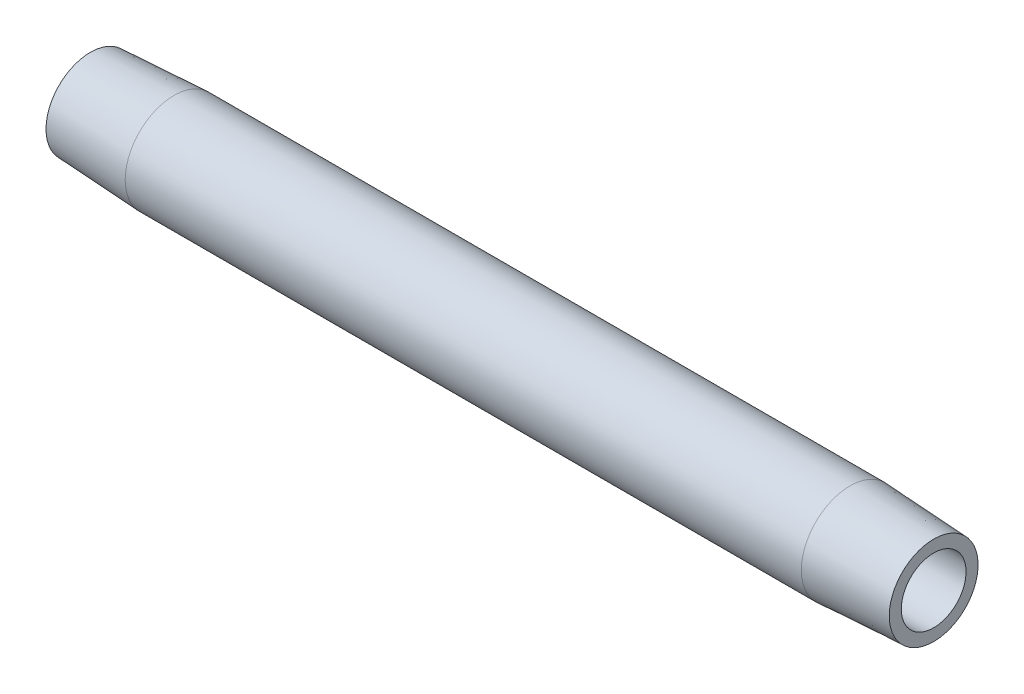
from build123d import *


with BuildPart() as part:
    # Sketch2 → Revolve1 (revolve)
    with BuildSketch(Plane.XY, mode=Mode.PRIVATE) as revolve1_sk:
        Polygon((8.810039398, 5.1435), (0, 4.6817854), (0, 3.4163), (88.9, 3.4163), (88.9, 4.6817854), (80.089960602, 5.1435), align=None)
    revolve(revolve1_sk.sketch.rotate(Axis((0.476141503, 0, 0), (1, 0, 0)), 90), axis=Axis((0.476141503, 0, 0), (1, 0, 0)))


solid = part.part
